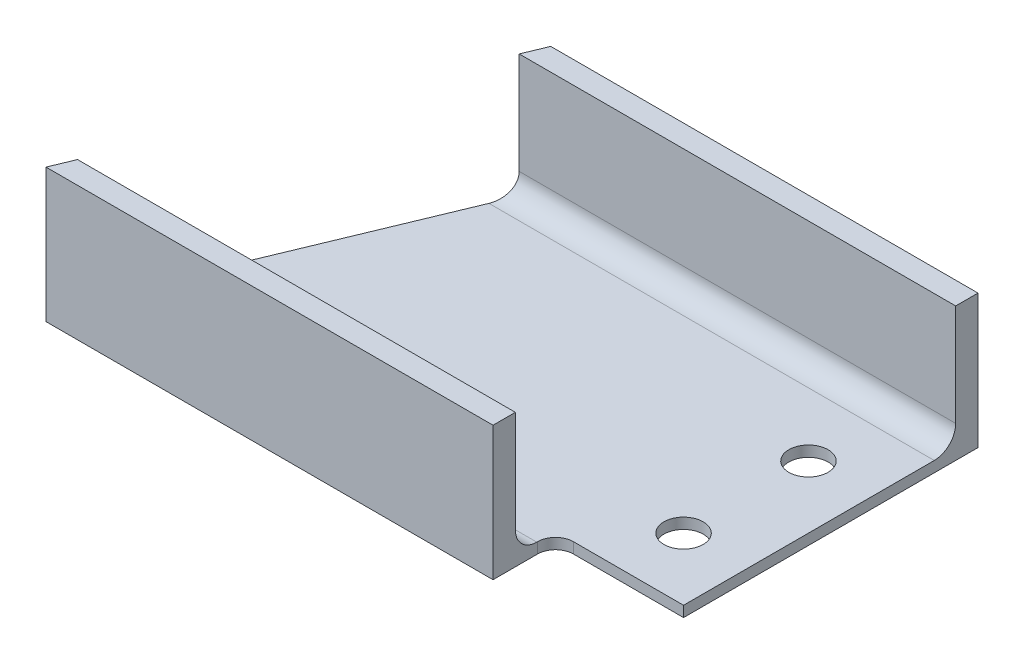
ISO-10303-21;
HEADER;
FILE_DESCRIPTION(('STEP AP214'),'2;1');
FILE_NAME('part.step','',(''),(''),'','','');
FILE_SCHEMA(('AUTOMOTIVE_DESIGN { 1 0 10303 214 1 1 1 1 }'));
ENDSEC;
DATA;
#1=APPLICATION_CONTEXT('core data for automotive mechanical design processes');
#2=APPLICATION_PROTOCOL_DEFINITION('international standard','automotive_design',2000,#1);
#3=PRODUCT_CONTEXT('',#1,'mechanical');
#4=PRODUCT('Part','Part','',(#3));
#5=PRODUCT_RELATED_PRODUCT_CATEGORY('part','',(#4));
#6=PRODUCT_DEFINITION_FORMATION('','',#4);
#7=PRODUCT_DEFINITION_CONTEXT('part definition',#1,'design');
#8=PRODUCT_DEFINITION('design','',#6,#7);
#9=PRODUCT_DEFINITION_SHAPE('','',#8);
#10=(LENGTH_UNIT() NAMED_UNIT(*) SI_UNIT(.MILLI.,.METRE.));
#11=(NAMED_UNIT(*) PLANE_ANGLE_UNIT() SI_UNIT($,.RADIAN.));
#12=(NAMED_UNIT(*) SI_UNIT($,.STERADIAN.) SOLID_ANGLE_UNIT());
#13=UNCERTAINTY_MEASURE_WITH_UNIT(LENGTH_MEASURE(1.E-05),#10,'distance_accuracy_value','');
#14=(GEOMETRIC_REPRESENTATION_CONTEXT(3) GLOBAL_UNCERTAINTY_ASSIGNED_CONTEXT((#13)) GLOBAL_UNIT_ASSIGNED_CONTEXT((#10,
#11,#12)) REPRESENTATION_CONTEXT('',''));
#15=CARTESIAN_POINT('',(0.,0.,0.));
#16=DIRECTION('',(0.,0.,1.));
#17=DIRECTION('',(1.,0.,0.));
#18=AXIS2_PLACEMENT_3D('',#15,#16,#17);
#19=CARTESIAN_POINT('',(345.,18.0000000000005,-175.5));
#20=DIRECTION('',(-1.,0.,0.));
#21=DIRECTION('',(0.,0.,1.));
#22=AXIS2_PLACEMENT_3D('',#19,#20,#21);
#23=CYLINDRICAL_SURFACE('',#22,12.);
#24=DIRECTION('',(-1.,0.,0.));
#25=VECTOR('',#24,1.);
#26=CARTESIAN_POINT('',(345.,6.00000000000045,-175.5));
#27=LINE('',#26,#25);
#28=CARTESIAN_POINT('',(322.249999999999,6.00000000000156,-175.499999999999));
#29=VERTEX_POINT('',#28);
#30=CARTESIAN_POINT('',(72.6944801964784,6.00000000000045,-175.5));
#31=VERTEX_POINT('',#30);
#32=EDGE_CURVE('E235',#29,#31,#27,.T.);
#33=ORIENTED_EDGE('',*,*,#32,.F.);
#34=CARTESIAN_POINT('',(322.249999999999,18.0000000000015,-175.499999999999));
#35=DIRECTION('',(1.,0.,0.));
#36=DIRECTION('',(0.,0.,-1.));
#37=AXIS2_PLACEMENT_3D('',#34,#35,#36);
#38=CIRCLE('',#37,12.);
#39=CARTESIAN_POINT('',(322.249999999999,18.0000000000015,-187.499999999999));
#40=VERTEX_POINT('',#39);
#41=EDGE_CURVE('E287',#40,#29,#38,.F.);
#42=ORIENTED_EDGE('',*,*,#41,.F.);
#43=DIRECTION('',(-1.,0.,0.));
#44=VECTOR('',#43,1.);
#45=CARTESIAN_POINT('',(345.,18.0000000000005,-187.5));
#46=LINE('',#45,#44);
#47=CARTESIAN_POINT('',(77.6650429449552,18.0000000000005,-187.5));
#48=VERTEX_POINT('',#47);
#49=EDGE_CURVE('E213',#40,#48,#46,.T.);
#50=ORIENTED_EDGE('',*,*,#49,.T.);
#51=CARTESIAN_POINT('',(72.6944801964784,18.0000000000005,-175.5));
#52=DIRECTION('',(-0.923879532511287,0.,-0.38268343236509));
#53=DIRECTION('',(-0.38268343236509,0.,0.923879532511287));
#54=AXIS2_PLACEMENT_3D('',#51,#52,#53);
#55=ELLIPSE('',#54,12.9887064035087,12.);
#56=EDGE_CURVE('E232',#48,#31,#55,.T.);
#57=ORIENTED_EDGE('',*,*,#56,.T.);
#58=EDGE_LOOP('',(#33,#42,#50,#57));
#59=FACE_BOUND('',#58,.T.);
#60=ADVANCED_FACE('F74',(#59),#23,.F.);
#61=CARTESIAN_POINT('',(345.,5.99999999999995,-24.5000000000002));
#62=DIRECTION('',(0.,1.,0.));
#63=DIRECTION('',(0.,0.,1.));
#64=AXIS2_PLACEMENT_3D('',#61,#62,#63);
#65=PLANE('',#64);
#66=CARTESIAN_POINT('',(287.249999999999,6.00000000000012,-69.9999999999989));
#67=DIRECTION('',(0.,1.,0.));
#68=DIRECTION('',(0.,0.,1.));
#69=AXIS2_PLACEMENT_3D('',#66,#67,#68);
#70=CIRCLE('',#69,11.);
#71=CARTESIAN_POINT('',(287.249999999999,6.00000000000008,-58.9999999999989));
#72=VERTEX_POINT('',#71);
#73=EDGE_CURVE('E206',#72,#72,#70,.F.);
#74=ORIENTED_EDGE('',*,*,#73,.T.);
#75=EDGE_LOOP('',(#74));
#76=FACE_BOUND('',#75,.T.);
#77=CARTESIAN_POINT('',(287.249999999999,6.00000000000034,-139.999999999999));
#78=DIRECTION('',(0.,1.,0.));
#79=DIRECTION('',(0.,0.,1.));
#80=AXIS2_PLACEMENT_3D('',#77,#78,#79);
#81=CIRCLE('',#80,11.);
#82=CARTESIAN_POINT('',(287.249999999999,6.0000000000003,-128.999999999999));
#83=VERTEX_POINT('',#82);
#84=EDGE_CURVE('E210',#83,#83,#81,.F.);
#85=ORIENTED_EDGE('',*,*,#84,.T.);
#86=EDGE_LOOP('',(#85));
#87=FACE_BOUND('',#86,.T.);
#88=DIRECTION('',(-1.,0.,0.));
#89=VECTOR('',#88,1.);
#90=CARTESIAN_POINT('',(-55.0000000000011,6.00000000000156,-34.9999999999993));
#91=LINE('',#90,#89);
#92=CARTESIAN_POINT('',(322.249999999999,6.00000000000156,-34.9999999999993));
#93=VERTEX_POINT('',#92);
#94=CARTESIAN_POINT('',(260.499999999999,6.00000000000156,-34.9999999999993));
#95=VERTEX_POINT('',#94);
#96=EDGE_CURVE('E189',#93,#95,#91,.T.);
#97=ORIENTED_EDGE('',*,*,#96,.F.);
#98=DIRECTION('',(0.,0.,1.));
#99=VECTOR('',#98,1.);
#100=CARTESIAN_POINT('',(322.249999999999,6.0000000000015,-24.4999999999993));
#101=LINE('',#100,#99);
#102=EDGE_CURVE('E203',#29,#93,#101,.T.);
#103=ORIENTED_EDGE('',*,*,#102,.F.);
#104=ORIENTED_EDGE('',*,*,#32,.T.);
#105=DIRECTION('',(-0.38268343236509,0.,0.923879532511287));
#106=VECTOR('',#105,1.);
#107=CARTESIAN_POINT('',(59.1861383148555,6.00000000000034,-142.887977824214));
#108=LINE('',#107,#106);
#109=CARTESIAN_POINT('',(10.1482322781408,5.99999999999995,-24.5000000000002));
#110=VERTEX_POINT('',#109);
#111=EDGE_CURVE('E236',#31,#110,#108,.T.);
#112=ORIENTED_EDGE('',*,*,#111,.T.);
#113=DIRECTION('',(-1.,0.,0.));
#114=VECTOR('',#113,1.);
#115=CARTESIAN_POINT('',(345.,5.99999999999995,-24.5000000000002));
#116=LINE('',#115,#114);
#117=CARTESIAN_POINT('',(250.499999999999,6.0000000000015,-24.4999999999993));
#118=VERTEX_POINT('',#117);
#119=EDGE_CURVE('E194',#118,#110,#116,.T.);
#120=ORIENTED_EDGE('',*,*,#119,.F.);
#121=DIRECTION('',(0.,0.,1.));
#122=VECTOR('',#121,1.);
#123=CARTESIAN_POINT('',(250.499999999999,6.0000000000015,-24.4999999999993));
#124=LINE('',#123,#122);
#125=CARTESIAN_POINT('',(250.499999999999,6.00000000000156,-24.999999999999));
#126=VERTEX_POINT('',#125);
#127=EDGE_CURVE('E174',#126,#118,#124,.T.);
#128=ORIENTED_EDGE('',*,*,#127,.F.);
#129=CARTESIAN_POINT('',(260.499999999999,6.00000000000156,-24.999999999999));
#130=DIRECTION('',(0.,-1.,0.));
#131=DIRECTION('',(1.,0.,0.));
#132=AXIS2_PLACEMENT_3D('',#129,#130,#131);
#133=CIRCLE('',#132,10.);
#134=EDGE_CURVE('E184',#95,#126,#133,.F.);
#135=ORIENTED_EDGE('',*,*,#134,.F.);
#136=EDGE_LOOP('',(#97,#103,#104,#112,#120,#128,#135));
#137=FACE_BOUND('',#136,.T.);
#138=ADVANCED_FACE('F192',(#76,#87,#137),#65,.T.);
#139=CARTESIAN_POINT('',(345.,18.,-24.4999999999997));
#140=DIRECTION('',(-1.,0.,0.));
#141=DIRECTION('',(0.,0.,1.));
#142=AXIS2_PLACEMENT_3D('',#139,#140,#141);
#143=CYLINDRICAL_SURFACE('',#142,12.);
#144=CARTESIAN_POINT('',(250.499999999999,18.0000000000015,-24.4999999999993));
#145=DIRECTION('',(1.,0.,0.));
#146=DIRECTION('',(0.,0.,-1.));
#147=AXIS2_PLACEMENT_3D('',#144,#145,#146);
#148=CIRCLE('',#147,12.);
#149=CARTESIAN_POINT('',(250.499999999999,18.0000000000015,-12.4999999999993));
#150=VERTEX_POINT('',#149);
#151=EDGE_CURVE('E298',#150,#118,#148,.T.);
#152=ORIENTED_EDGE('',*,*,#151,.T.);
#153=ORIENTED_EDGE('',*,*,#119,.T.);
#154=CARTESIAN_POINT('',(10.1482322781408,18.,-24.4999999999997));
#155=DIRECTION('',(-0.923879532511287,0.,-0.38268343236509));
#156=DIRECTION('',(-0.38268343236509,0.,0.923879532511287));
#157=AXIS2_PLACEMENT_3D('',#154,#155,#156);
#158=ELLIPSE('',#157,12.9887064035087,12.);
#159=CARTESIAN_POINT('',(5.17766952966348,17.9999999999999,-12.4999999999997));
#160=VERTEX_POINT('',#159);
#161=EDGE_CURVE('E215',#160,#110,#158,.F.);
#162=ORIENTED_EDGE('',*,*,#161,.F.);
#163=DIRECTION('',(-1.,0.,0.));
#164=VECTOR('',#163,1.);
#165=CARTESIAN_POINT('',(345.,17.9999999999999,-12.4999999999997));
#166=LINE('',#165,#164);
#167=EDGE_CURVE('E244',#150,#160,#166,.T.);
#168=ORIENTED_EDGE('',*,*,#167,.F.);
#169=EDGE_LOOP('',(#152,#153,#162,#168));
#170=FACE_BOUND('',#169,.T.);
#171=ADVANCED_FACE('F325',(#170),#143,.F.);
#172=CARTESIAN_POINT('',(345.,75.0000000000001,-12.4999999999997));
#173=DIRECTION('',(0.,0.,-1.));
#174=DIRECTION('',(0.,1.,0.));
#175=AXIS2_PLACEMENT_3D('',#172,#173,#174);
#176=PLANE('',#175);
#177=DIRECTION('',(-1.,0.,0.));
#178=VECTOR('',#177,1.);
#179=CARTESIAN_POINT('',(345.,75.0000000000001,-12.4999999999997));
#180=LINE('',#179,#178);
#181=CARTESIAN_POINT('',(250.499999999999,75.0000000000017,-12.4999999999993));
#182=VERTEX_POINT('',#181);
#183=CARTESIAN_POINT('',(5.17766952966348,75.0000000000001,-12.4999999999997));
#184=VERTEX_POINT('',#183);
#185=EDGE_CURVE('E243',#182,#184,#180,.T.);
#186=ORIENTED_EDGE('',*,*,#185,.F.);
#187=DIRECTION('',(0.,1.,0.));
#188=VECTOR('',#187,1.);
#189=CARTESIAN_POINT('',(250.499999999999,75.0000000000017,-12.4999999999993));
#190=LINE('',#189,#188);
#191=EDGE_CURVE('E296',#150,#182,#190,.T.);
#192=ORIENTED_EDGE('',*,*,#191,.F.);
#193=ORIENTED_EDGE('',*,*,#167,.T.);
#194=DIRECTION('',(0.,1.,0.));
#195=VECTOR('',#194,1.);
#196=CARTESIAN_POINT('',(5.17766952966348,74.9999999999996,-12.4999999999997));
#197=LINE('',#196,#195);
#198=EDGE_CURVE('E240',#160,#184,#197,.T.);
#199=ORIENTED_EDGE('',*,*,#198,.T.);
#200=EDGE_LOOP('',(#186,#192,#193,#199));
#201=FACE_BOUND('',#200,.T.);
#202=ADVANCED_FACE('F329',(#201),#176,.T.);
#203=CARTESIAN_POINT('',(345.,75.,4.44089209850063E-13));
#204=DIRECTION('',(0.,1.,0.));
#205=DIRECTION('',(0.,0.,1.));
#206=AXIS2_PLACEMENT_3D('',#203,#204,#205);
#207=PLANE('',#206);
#208=DIRECTION('',(-1.,0.,0.));
#209=VECTOR('',#208,1.);
#210=CARTESIAN_POINT('',(345.,75.,4.44089209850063E-13));
#211=LINE('',#210,#209);
#212=CARTESIAN_POINT('',(250.499999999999,75.,4.44089209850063E-13));
#213=VERTEX_POINT('',#212);
#214=CARTESIAN_POINT('',(0.,75.0000000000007,0.));
#215=VERTEX_POINT('',#214);
#216=EDGE_CURVE('E98',#213,#215,#211,.T.);
#217=ORIENTED_EDGE('',*,*,#216,.F.);
#218=DIRECTION('',(0.,0.,1.));
#219=VECTOR('',#218,1.);
#220=CARTESIAN_POINT('',(250.499999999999,75.0000000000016,8.88178419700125E-13));
#221=LINE('',#220,#219);
#222=EDGE_CURVE('E91',#182,#213,#221,.T.);
#223=ORIENTED_EDGE('',*,*,#222,.F.);
#224=ORIENTED_EDGE('',*,*,#185,.T.);
#225=DIRECTION('',(-0.38268343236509,0.,0.923879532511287));
#226=VECTOR('',#225,1.);
#227=CARTESIAN_POINT('',(50.5240802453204,75.0000000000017,-121.975919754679));
#228=LINE('',#227,#226);
#229=EDGE_CURVE('E219',#184,#215,#228,.T.);
#230=ORIENTED_EDGE('',*,*,#229,.T.);
#231=EDGE_LOOP('',(#217,#223,#224,#230));
#232=FACE_BOUND('',#231,.T.);
#233=ADVANCED_FACE('F263',(#232),#207,.T.);
#234=CARTESIAN_POINT('',(345.,0.,0.));
#235=DIRECTION('',(0.,1.,0.));
#236=DIRECTION('',(0.,0.,1.));
#237=AXIS2_PLACEMENT_3D('',#234,#235,#236);
#238=PLANE('',#237);
#239=CARTESIAN_POINT('',(287.249999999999,4.44089209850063E-13,-139.999999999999));
#240=DIRECTION('',(0.,1.,0.));
#241=DIRECTION('',(0.,0.,1.));
#242=AXIS2_PLACEMENT_3D('',#239,#240,#241);
#243=CIRCLE('',#242,11.);
#244=CARTESIAN_POINT('',(287.249999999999,4.106405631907E-13,-128.999999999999));
#245=VERTEX_POINT('',#244);
#246=EDGE_CURVE('E209',#245,#245,#243,.F.);
#247=ORIENTED_EDGE('',*,*,#246,.F.);
#248=EDGE_LOOP('',(#247));
#249=FACE_BOUND('',#248,.T.);
#250=CARTESIAN_POINT('',(287.249999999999,2.22044604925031E-13,-69.9999999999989));
#251=DIRECTION('',(0.,1.,0.));
#252=DIRECTION('',(0.,0.,1.));
#253=AXIS2_PLACEMENT_3D('',#250,#251,#252);
#254=CIRCLE('',#253,11.);
#255=CARTESIAN_POINT('',(287.249999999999,1.88595958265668E-13,-58.9999999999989));
#256=VERTEX_POINT('',#255);
#257=EDGE_CURVE('E78',#256,#256,#254,.F.);
#258=ORIENTED_EDGE('',*,*,#257,.F.);
#259=EDGE_LOOP('',(#258));
#260=FACE_BOUND('',#259,.T.);
#261=DIRECTION('',(0.,0.,1.));
#262=VECTOR('',#261,1.);
#263=CARTESIAN_POINT('',(322.249999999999,1.66533453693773E-12,8.88178419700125E-13));
#264=LINE('',#263,#262);
#265=CARTESIAN_POINT('',(322.249999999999,1.60982338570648E-12,-199.999999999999));
#266=VERTEX_POINT('',#265);
#267=CARTESIAN_POINT('',(322.249999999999,1.66533453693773E-12,-34.9999999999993));
#268=VERTEX_POINT('',#267);
#269=EDGE_CURVE('E195',#266,#268,#264,.T.);
#270=ORIENTED_EDGE('',*,*,#269,.T.);
#271=DIRECTION('',(-1.,0.,0.));
#272=VECTOR('',#271,1.);
#273=CARTESIAN_POINT('',(-55.0000000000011,1.66533453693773E-12,-34.9999999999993));
#274=LINE('',#273,#272);
#275=CARTESIAN_POINT('',(260.499999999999,1.66533453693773E-12,-34.9999999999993));
#276=VERTEX_POINT('',#275);
#277=EDGE_CURVE('E271',#268,#276,#274,.T.);
#278=ORIENTED_EDGE('',*,*,#277,.T.);
#279=CARTESIAN_POINT('',(260.499999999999,1.66533453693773E-12,-24.999999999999));
#280=DIRECTION('',(0.,-1.,0.));
#281=DIRECTION('',(0.,0.,1.));
#282=AXIS2_PLACEMENT_3D('',#279,#280,#281);
#283=CIRCLE('',#282,10.);
#284=CARTESIAN_POINT('',(250.499999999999,1.66533453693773E-12,-24.999999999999));
#285=VERTEX_POINT('',#284);
#286=EDGE_CURVE('E290',#276,#285,#283,.F.);
#287=ORIENTED_EDGE('',*,*,#286,.T.);
#288=DIRECTION('',(0.,0.,1.));
#289=VECTOR('',#288,1.);
#290=CARTESIAN_POINT('',(250.499999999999,1.66533453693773E-12,8.88178419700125E-13));
#291=LINE('',#290,#289);
#292=CARTESIAN_POINT('',(250.499999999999,1.66533453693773E-12,8.88178419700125E-13));
#293=VERTEX_POINT('',#292);
#294=EDGE_CURVE('E177',#285,#293,#291,.T.);
#295=ORIENTED_EDGE('',*,*,#294,.T.);
#296=DIRECTION('',(-1.,0.,0.));
#297=VECTOR('',#296,1.);
#298=CARTESIAN_POINT('',(345.,0.,0.));
#299=LINE('',#298,#297);
#300=CARTESIAN_POINT('',(0.,0.,0.));
#301=VERTEX_POINT('',#300);
#302=EDGE_CURVE('E217',#293,#301,#299,.T.);
#303=ORIENTED_EDGE('',*,*,#302,.T.);
#304=DIRECTION('',(-0.38268343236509,0.,0.923879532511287));
#305=VECTOR('',#304,1.);
#306=CARTESIAN_POINT('',(50.5240802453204,3.88578058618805E-13,-121.975919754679));
#307=LINE('',#306,#305);
#308=CARTESIAN_POINT('',(82.8427124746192,6.10622663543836E-13,-200.));
#309=VERTEX_POINT('',#308);
#310=EDGE_CURVE('E83',#309,#301,#307,.T.);
#311=ORIENTED_EDGE('',*,*,#310,.F.);
#312=DIRECTION('',(-1.,0.,0.));
#313=VECTOR('',#312,1.);
#314=CARTESIAN_POINT('',(345.,6.10622663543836E-13,-200.));
#315=LINE('',#314,#313);
#316=EDGE_CURVE('E218',#266,#309,#315,.T.);
#317=ORIENTED_EDGE('',*,*,#316,.F.);
#318=EDGE_LOOP('',(#270,#278,#287,#295,#303,#311,#317));
#319=FACE_BOUND('',#318,.T.);
#320=ADVANCED_FACE('F259',(#249,#260,#319),#238,.F.);
#321=CARTESIAN_POINT('',(345.,6.10622663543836E-13,-200.));
#322=DIRECTION('',(0.,0.,1.));
#323=DIRECTION('',(0.,-1.,0.));
#324=AXIS2_PLACEMENT_3D('',#321,#322,#323);
#325=PLANE('',#324);
#326=DIRECTION('',(0.,-1.,0.));
#327=VECTOR('',#326,1.);
#328=CARTESIAN_POINT('',(322.249999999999,1.60982338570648E-12,-199.999999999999));
#329=LINE('',#328,#327);
#330=CARTESIAN_POINT('',(322.249999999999,75.0000000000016,-199.999999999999));
#331=VERTEX_POINT('',#330);
#332=EDGE_CURVE('E198',#331,#266,#329,.T.);
#333=ORIENTED_EDGE('',*,*,#332,.T.);
#334=ORIENTED_EDGE('',*,*,#316,.T.);
#335=DIRECTION('',(0.,-1.,0.));
#336=VECTOR('',#335,1.);
#337=CARTESIAN_POINT('',(82.8427124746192,2.22044604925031E-13,-200.));
#338=LINE('',#337,#336);
#339=CARTESIAN_POINT('',(82.8427124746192,75.0000000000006,-200.));
#340=VERTEX_POINT('',#339);
#341=EDGE_CURVE('E223',#340,#309,#338,.T.);
#342=ORIENTED_EDGE('',*,*,#341,.F.);
#343=DIRECTION('',(-1.,0.,0.));
#344=VECTOR('',#343,1.);
#345=CARTESIAN_POINT('',(345.,75.0000000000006,-200.));
#346=LINE('',#345,#344);
#347=EDGE_CURVE('E251',#331,#340,#346,.T.);
#348=ORIENTED_EDGE('',*,*,#347,.F.);
#349=EDGE_LOOP('',(#333,#334,#342,#348));
#350=FACE_BOUND('',#349,.T.);
#351=ADVANCED_FACE('F262',(#350),#325,.F.);
#352=CARTESIAN_POINT('',(345.,75.0000000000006,-200.));
#353=DIRECTION('',(0.,-1.,0.));
#354=DIRECTION('',(0.,0.,-1.));
#355=AXIS2_PLACEMENT_3D('',#352,#353,#354);
#356=PLANE('',#355);
#357=DIRECTION('',(0.,0.,-1.));
#358=VECTOR('',#357,1.);
#359=CARTESIAN_POINT('',(322.249999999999,75.0000000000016,-199.999999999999));
#360=LINE('',#359,#358);
#361=CARTESIAN_POINT('',(322.249999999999,75.0000000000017,-187.499999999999));
#362=VERTEX_POINT('',#361);
#363=EDGE_CURVE('E281',#362,#331,#360,.T.);
#364=ORIENTED_EDGE('',*,*,#363,.T.);
#365=ORIENTED_EDGE('',*,*,#347,.T.);
#366=DIRECTION('',(0.38268343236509,0.,-0.923879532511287));
#367=VECTOR('',#366,1.);
#368=CARTESIAN_POINT('',(121.234758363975,74.9999999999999,-292.686597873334));
#369=LINE('',#368,#367);
#370=CARTESIAN_POINT('',(77.6650429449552,75.0000000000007,-187.5));
#371=VERTEX_POINT('',#370);
#372=EDGE_CURVE('E226',#371,#340,#369,.T.);
#373=ORIENTED_EDGE('',*,*,#372,.F.);
#374=DIRECTION('',(-1.,0.,0.));
#375=VECTOR('',#374,1.);
#376=CARTESIAN_POINT('',(345.,75.0000000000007,-187.5));
#377=LINE('',#376,#375);
#378=EDGE_CURVE('E216',#362,#371,#377,.T.);
#379=ORIENTED_EDGE('',*,*,#378,.F.);
#380=EDGE_LOOP('',(#364,#365,#373,#379));
#381=FACE_BOUND('',#380,.T.);
#382=ADVANCED_FACE('F312',(#381),#356,.F.);
#383=CARTESIAN_POINT('',(345.,75.0000000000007,-187.5));
#384=DIRECTION('',(0.,0.,-1.));
#385=DIRECTION('',(0.,1.,0.));
#386=AXIS2_PLACEMENT_3D('',#383,#384,#385);
#387=PLANE('',#386);
#388=DIRECTION('',(0.,1.,0.));
#389=VECTOR('',#388,1.);
#390=CARTESIAN_POINT('',(322.249999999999,75.0000000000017,-187.499999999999));
#391=LINE('',#390,#389);
#392=EDGE_CURVE('E282',#40,#362,#391,.T.);
#393=ORIENTED_EDGE('',*,*,#392,.T.);
#394=ORIENTED_EDGE('',*,*,#378,.T.);
#395=DIRECTION('',(0.,1.,0.));
#396=VECTOR('',#395,1.);
#397=CARTESIAN_POINT('',(77.6650429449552,75.0000000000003,-187.5));
#398=LINE('',#397,#396);
#399=EDGE_CURVE('E229',#48,#371,#398,.T.);
#400=ORIENTED_EDGE('',*,*,#399,.F.);
#401=ORIENTED_EDGE('',*,*,#49,.F.);
#402=EDGE_LOOP('',(#393,#394,#400,#401));
#403=FACE_BOUND('',#402,.T.);
#404=ADVANCED_FACE('F316',(#403),#387,.F.);
#405=CARTESIAN_POINT('',(345.,0.,0.));
#406=DIRECTION('',(0.,0.,1.));
#407=DIRECTION('',(0.,-1.,0.));
#408=AXIS2_PLACEMENT_3D('',#405,#406,#407);
#409=PLANE('',#408);
#410=ORIENTED_EDGE('',*,*,#302,.F.);
#411=DIRECTION('',(0.,-1.,0.));
#412=VECTOR('',#411,1.);
#413=CARTESIAN_POINT('',(250.499999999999,1.66533453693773E-12,8.88178419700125E-13));
#414=LINE('',#413,#412);
#415=EDGE_CURVE('E293',#213,#293,#414,.T.);
#416=ORIENTED_EDGE('',*,*,#415,.F.);
#417=ORIENTED_EDGE('',*,*,#216,.T.);
#418=DIRECTION('',(0.,1.,0.));
#419=VECTOR('',#418,1.);
#420=CARTESIAN_POINT('',(0.,18.0000000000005,0.));
#421=LINE('',#420,#419);
#422=EDGE_CURVE('E13',#301,#215,#421,.T.);
#423=ORIENTED_EDGE('',*,*,#422,.F.);
#424=EDGE_LOOP('',(#410,#416,#417,#423));
#425=FACE_BOUND('',#424,.T.);
#426=ADVANCED_FACE('F304',(#425),#409,.T.);
#427=CARTESIAN_POINT('',(0.,0.,0.));
#428=DIRECTION('',(-0.923879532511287,0.,-0.38268343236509));
#429=DIRECTION('',(-0.38268343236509,0.,0.923879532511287));
#430=AXIS2_PLACEMENT_3D('',#427,#428,#429);
#431=PLANE('',#430);
#432=ORIENTED_EDGE('',*,*,#229,.F.);
#433=ORIENTED_EDGE('',*,*,#198,.F.);
#434=ORIENTED_EDGE('',*,*,#161,.T.);
#435=ORIENTED_EDGE('',*,*,#111,.F.);
#436=ORIENTED_EDGE('',*,*,#56,.F.);
#437=ORIENTED_EDGE('',*,*,#399,.T.);
#438=ORIENTED_EDGE('',*,*,#372,.T.);
#439=ORIENTED_EDGE('',*,*,#341,.T.);
#440=ORIENTED_EDGE('',*,*,#310,.T.);
#441=ORIENTED_EDGE('',*,*,#422,.T.);
#442=EDGE_LOOP('',(#432,#433,#434,#435,#436,#437,#438,#439,#440,#441));
#443=FACE_BOUND('',#442,.T.);
#444=ADVANCED_FACE('F76',(#443),#431,.T.);
#445=CARTESIAN_POINT('',(287.249999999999,-81.9999999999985,-139.999999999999));
#446=DIRECTION('',(0.,1.,0.));
#447=DIRECTION('',(-1.,0.,0.));
#448=AXIS2_PLACEMENT_3D('',#445,#446,#447);
#449=CYLINDRICAL_SURFACE('',#448,11.);
#450=ORIENTED_EDGE('',*,*,#84,.F.);
#451=EDGE_LOOP('',(#450));
#452=FACE_BOUND('',#451,.T.);
#453=ORIENTED_EDGE('',*,*,#246,.T.);
#454=EDGE_LOOP('',(#453));
#455=FACE_BOUND('',#454,.T.);
#456=ADVANCED_FACE('F257',(#452,#455),#449,.F.);
#457=CARTESIAN_POINT('',(287.249999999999,-81.9999999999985,-69.9999999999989));
#458=DIRECTION('',(0.,1.,0.));
#459=DIRECTION('',(-1.,0.,0.));
#460=AXIS2_PLACEMENT_3D('',#457,#458,#459);
#461=CYLINDRICAL_SURFACE('',#460,11.);
#462=ORIENTED_EDGE('',*,*,#73,.F.);
#463=EDGE_LOOP('',(#462));
#464=FACE_BOUND('',#463,.T.);
#465=ORIENTED_EDGE('',*,*,#257,.T.);
#466=EDGE_LOOP('',(#465));
#467=FACE_BOUND('',#466,.T.);
#468=ADVANCED_FACE('F401',(#464,#467),#461,.F.);
#469=CARTESIAN_POINT('',(260.499999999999,150.000000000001,-34.9999999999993));
#470=DIRECTION('',(0.,0.,1.));
#471=DIRECTION('',(1.,0.,0.));
#472=AXIS2_PLACEMENT_3D('',#469,#470,#471);
#473=PLANE('',#472);
#474=ORIENTED_EDGE('',*,*,#277,.F.);
#475=DIRECTION('',(0.,-1.,0.));
#476=VECTOR('',#475,1.);
#477=CARTESIAN_POINT('',(322.249999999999,150.000000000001,-34.9999999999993));
#478=LINE('',#477,#476);
#479=EDGE_CURVE('E277',#93,#268,#478,.T.);
#480=ORIENTED_EDGE('',*,*,#479,.F.);
#481=ORIENTED_EDGE('',*,*,#96,.T.);
#482=DIRECTION('',(0.,-1.,0.));
#483=VECTOR('',#482,1.);
#484=CARTESIAN_POINT('',(260.499999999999,150.000000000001,-34.9999999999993));
#485=LINE('',#484,#483);
#486=EDGE_CURVE('E181',#95,#276,#485,.T.);
#487=ORIENTED_EDGE('',*,*,#486,.T.);
#488=EDGE_LOOP('',(#474,#480,#481,#487));
#489=FACE_BOUND('',#488,.T.);
#490=ADVANCED_FACE('F302',(#489),#473,.T.);
#491=CARTESIAN_POINT('',(260.499999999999,150.000000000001,-24.999999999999));
#492=DIRECTION('',(0.,-1.,0.));
#493=DIRECTION('',(1.,0.,0.));
#494=AXIS2_PLACEMENT_3D('',#491,#492,#493);
#495=CYLINDRICAL_SURFACE('',#494,10.);
#496=ORIENTED_EDGE('',*,*,#286,.F.);
#497=ORIENTED_EDGE('',*,*,#486,.F.);
#498=ORIENTED_EDGE('',*,*,#134,.T.);
#499=DIRECTION('',(0.,-1.,0.));
#500=VECTOR('',#499,1.);
#501=CARTESIAN_POINT('',(250.499999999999,150.000000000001,-24.999999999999));
#502=LINE('',#501,#500);
#503=EDGE_CURVE('E170',#126,#285,#502,.T.);
#504=ORIENTED_EDGE('',*,*,#503,.T.);
#505=EDGE_LOOP('',(#496,#497,#498,#504));
#506=FACE_BOUND('',#505,.T.);
#507=ADVANCED_FACE('F185',(#506),#495,.F.);
#508=CARTESIAN_POINT('',(322.249999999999,150.000000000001,-34.9999999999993));
#509=DIRECTION('',(1.,0.,0.));
#510=DIRECTION('',(0.,0.,-1.));
#511=AXIS2_PLACEMENT_3D('',#508,#509,#510);
#512=PLANE('',#511);
#513=ORIENTED_EDGE('',*,*,#269,.F.);
#514=ORIENTED_EDGE('',*,*,#332,.F.);
#515=ORIENTED_EDGE('',*,*,#363,.F.);
#516=ORIENTED_EDGE('',*,*,#392,.F.);
#517=ORIENTED_EDGE('',*,*,#41,.T.);
#518=ORIENTED_EDGE('',*,*,#102,.T.);
#519=ORIENTED_EDGE('',*,*,#479,.T.);
#520=EDGE_LOOP('',(#513,#514,#515,#516,#517,#518,#519));
#521=FACE_BOUND('',#520,.T.);
#522=ADVANCED_FACE('F275',(#521),#512,.T.);
#523=CARTESIAN_POINT('',(250.499999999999,150.000000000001,200.000000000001));
#524=DIRECTION('',(1.,0.,0.));
#525=DIRECTION('',(0.,0.,-1.));
#526=AXIS2_PLACEMENT_3D('',#523,#524,#525);
#527=PLANE('',#526);
#528=ORIENTED_EDGE('',*,*,#294,.F.);
#529=ORIENTED_EDGE('',*,*,#503,.F.);
#530=ORIENTED_EDGE('',*,*,#127,.T.);
#531=ORIENTED_EDGE('',*,*,#151,.F.);
#532=ORIENTED_EDGE('',*,*,#191,.T.);
#533=ORIENTED_EDGE('',*,*,#222,.T.);
#534=ORIENTED_EDGE('',*,*,#415,.T.);
#535=EDGE_LOOP('',(#528,#529,#530,#531,#532,#533,#534));
#536=FACE_BOUND('',#535,.T.);
#537=ADVANCED_FACE('F172',(#536),#527,.T.);
#538=CLOSED_SHELL('',(#60,#138,#171,#202,#233,#320,#351,#382,#404,#426,#444,#456,#468,#490,#507,
#522,#537));
#539=MANIFOLD_SOLID_BREP('B2',#538);
#540=ADVANCED_BREP_SHAPE_REPRESENTATION('',(#18,#539),#14);
#541=SHAPE_DEFINITION_REPRESENTATION(#9,#540);
ENDSEC;
END-ISO-10303-21;
